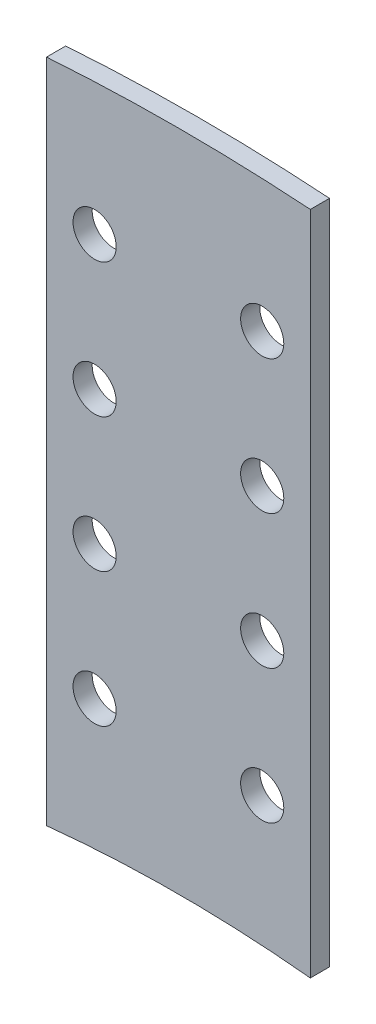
ISO-10303-21;
HEADER;
FILE_DESCRIPTION(('STEP AP214'),'2;1');
FILE_NAME('part.step','',(''),(''),'','','');
FILE_SCHEMA(('AUTOMOTIVE_DESIGN { 1 0 10303 214 1 1 1 1 }'));
ENDSEC;
DATA;
#1=APPLICATION_CONTEXT('core data for automotive mechanical design processes');
#2=APPLICATION_PROTOCOL_DEFINITION('international standard','automotive_design',2000,#1);
#3=PRODUCT_CONTEXT('',#1,'mechanical');
#4=PRODUCT('Part','Part','',(#3));
#5=PRODUCT_RELATED_PRODUCT_CATEGORY('part','',(#4));
#6=PRODUCT_DEFINITION_FORMATION('','',#4);
#7=PRODUCT_DEFINITION_CONTEXT('part definition',#1,'design');
#8=PRODUCT_DEFINITION('design','',#6,#7);
#9=PRODUCT_DEFINITION_SHAPE('','',#8);
#10=(LENGTH_UNIT() NAMED_UNIT(*) SI_UNIT(.MILLI.,.METRE.));
#11=(NAMED_UNIT(*) PLANE_ANGLE_UNIT() SI_UNIT($,.RADIAN.));
#12=(NAMED_UNIT(*) SI_UNIT($,.STERADIAN.) SOLID_ANGLE_UNIT());
#13=UNCERTAINTY_MEASURE_WITH_UNIT(LENGTH_MEASURE(1.E-05),#10,'distance_accuracy_value','');
#14=(GEOMETRIC_REPRESENTATION_CONTEXT(3) GLOBAL_UNCERTAINTY_ASSIGNED_CONTEXT((#13)) GLOBAL_UNIT_ASSIGNED_CONTEXT((#10,
#11,#12)) REPRESENTATION_CONTEXT('',''));
#15=CARTESIAN_POINT('',(0.,0.,0.));
#16=DIRECTION('',(0.,0.,1.));
#17=DIRECTION('',(1.,0.,0.));
#18=AXIS2_PLACEMENT_3D('',#15,#16,#17);
#19=CARTESIAN_POINT('',(0.,0.,8.));
#20=DIRECTION('',(0.,0.,-1.));
#21=DIRECTION('',(-1.,0.,0.));
#22=AXIS2_PLACEMENT_3D('',#19,#20,#21);
#23=PLANE('',#22);
#24=CARTESIAN_POINT('',(34.94,27.955,8.));
#25=DIRECTION('',(0.,0.,1.));
#26=DIRECTION('',(1.,0.,0.));
#27=AXIS2_PLACEMENT_3D('',#24,#25,#26);
#28=CIRCLE('',#27,9.00000000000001);
#29=CARTESIAN_POINT('',(43.94,27.955,8.));
#30=VERTEX_POINT('',#29);
#31=EDGE_CURVE('E327',#30,#30,#28,.T.);
#32=ORIENTED_EDGE('',*,*,#31,.F.);
#33=EDGE_LOOP('',(#32));
#34=FACE_BOUND('',#33,.T.);
#35=CARTESIAN_POINT('',(-34.94,27.955,8.));
#36=DIRECTION('',(0.,0.,1.));
#37=DIRECTION('',(1.,0.,0.));
#38=AXIS2_PLACEMENT_3D('',#35,#36,#37);
#39=CIRCLE('',#38,9.00000000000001);
#40=CARTESIAN_POINT('',(-25.94,27.955,8.));
#41=VERTEX_POINT('',#40);
#42=EDGE_CURVE('E335',#41,#41,#39,.T.);
#43=ORIENTED_EDGE('',*,*,#42,.F.);
#44=EDGE_LOOP('',(#43));
#45=FACE_BOUND('',#44,.T.);
#46=CARTESIAN_POINT('',(-34.94,83.835,8.));
#47=DIRECTION('',(0.,0.,1.));
#48=DIRECTION('',(1.,0.,0.));
#49=AXIS2_PLACEMENT_3D('',#46,#47,#48);
#50=CIRCLE('',#49,9.00000000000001);
#51=CARTESIAN_POINT('',(-25.94,83.835,8.));
#52=VERTEX_POINT('',#51);
#53=EDGE_CURVE('E342',#52,#52,#50,.T.);
#54=ORIENTED_EDGE('',*,*,#53,.F.);
#55=EDGE_LOOP('',(#54));
#56=FACE_BOUND('',#55,.T.);
#57=CARTESIAN_POINT('',(34.94,83.835,8.));
#58=DIRECTION('',(0.,0.,1.));
#59=DIRECTION('',(1.,0.,0.));
#60=AXIS2_PLACEMENT_3D('',#57,#58,#59);
#61=CIRCLE('',#60,9.00000000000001);
#62=CARTESIAN_POINT('',(43.94,83.835,8.));
#63=VERTEX_POINT('',#62);
#64=EDGE_CURVE('E132',#63,#63,#61,.T.);
#65=ORIENTED_EDGE('',*,*,#64,.F.);
#66=EDGE_LOOP('',(#65));
#67=FACE_BOUND('',#66,.T.);
#68=CARTESIAN_POINT('',(-34.94,-27.925,8.));
#69=DIRECTION('',(0.,0.,1.));
#70=DIRECTION('',(1.,0.,0.));
#71=AXIS2_PLACEMENT_3D('',#68,#69,#70);
#72=CIRCLE('',#71,9.00000000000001);
#73=CARTESIAN_POINT('',(-25.94,-27.925,8.));
#74=VERTEX_POINT('',#73);
#75=EDGE_CURVE('E144',#74,#74,#72,.T.);
#76=ORIENTED_EDGE('',*,*,#75,.F.);
#77=EDGE_LOOP('',(#76));
#78=FACE_BOUND('',#77,.T.);
#79=CARTESIAN_POINT('',(-34.94,-83.805,8.));
#80=DIRECTION('',(0.,0.,1.));
#81=DIRECTION('',(1.,0.,0.));
#82=AXIS2_PLACEMENT_3D('',#79,#80,#81);
#83=CIRCLE('',#82,9.00000000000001);
#84=CARTESIAN_POINT('',(-25.94,-83.805,8.));
#85=VERTEX_POINT('',#84);
#86=EDGE_CURVE('E152',#85,#85,#83,.T.);
#87=ORIENTED_EDGE('',*,*,#86,.F.);
#88=EDGE_LOOP('',(#87));
#89=FACE_BOUND('',#88,.T.);
#90=CARTESIAN_POINT('',(34.94,-27.925,8.));
#91=DIRECTION('',(0.,0.,1.));
#92=DIRECTION('',(1.,0.,0.));
#93=AXIS2_PLACEMENT_3D('',#90,#91,#92);
#94=CIRCLE('',#93,9.00000000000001);
#95=CARTESIAN_POINT('',(43.94,-27.925,8.));
#96=VERTEX_POINT('',#95);
#97=EDGE_CURVE('E160',#96,#96,#94,.T.);
#98=ORIENTED_EDGE('',*,*,#97,.F.);
#99=EDGE_LOOP('',(#98));
#100=FACE_BOUND('',#99,.T.);
#101=CARTESIAN_POINT('',(34.94,-83.805,8.));
#102=DIRECTION('',(0.,0.,1.));
#103=DIRECTION('',(1.,0.,0.));
#104=AXIS2_PLACEMENT_3D('',#101,#102,#103);
#105=CIRCLE('',#104,9.00000000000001);
#106=CARTESIAN_POINT('',(43.94,-83.805,8.));
#107=VERTEX_POINT('',#106);
#108=EDGE_CURVE('E12',#107,#107,#105,.T.);
#109=ORIENTED_EDGE('',*,*,#108,.F.);
#110=EDGE_LOOP('',(#109));
#111=FACE_BOUND('',#110,.T.);
#112=DIRECTION('',(0.,-1.,0.));
#113=VECTOR('',#112,1.);
#114=CARTESIAN_POINT('',(-55.,-139.715,8.));
#115=LINE('',#114,#113);
#116=CARTESIAN_POINT('',(-55.,137.819642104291,8.));
#117=VERTEX_POINT('',#116);
#118=CARTESIAN_POINT('',(-55.,-139.715,8.));
#119=VERTEX_POINT('',#118);
#120=EDGE_CURVE('E109',#117,#119,#115,.T.);
#121=ORIENTED_EDGE('',*,*,#120,.T.);
#122=CARTESIAN_POINT('',(0.,-676.906772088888,8.));
#123=DIRECTION('',(0.,0.,1.));
#124=DIRECTION('',(1.,0.,0.));
#125=AXIS2_PLACEMENT_3D('',#122,#123,#124);
#126=CIRCLE('',#125,540.);
#127=CARTESIAN_POINT('',(55.,-139.715,8.));
#128=VERTEX_POINT('',#127);
#129=EDGE_CURVE('E101',#128,#119,#126,.T.);
#130=ORIENTED_EDGE('',*,*,#129,.F.);
#131=DIRECTION('',(0.,1.,0.));
#132=VECTOR('',#131,1.);
#133=CARTESIAN_POINT('',(55.,-139.715,8.));
#134=LINE('',#133,#132);
#135=CARTESIAN_POINT('',(55.,137.819642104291,8.));
#136=VERTEX_POINT('',#135);
#137=EDGE_CURVE('E114',#128,#136,#134,.T.);
#138=ORIENTED_EDGE('',*,*,#137,.T.);
#139=CARTESIAN_POINT('',(0.,-659.235,8.));
#140=DIRECTION('',(0.,0.,1.));
#141=DIRECTION('',(1.,0.,0.));
#142=AXIS2_PLACEMENT_3D('',#139,#140,#141);
#143=CIRCLE('',#142,798.95);
#144=EDGE_CURVE('E312',#136,#117,#143,.T.);
#145=ORIENTED_EDGE('',*,*,#144,.T.);
#146=EDGE_LOOP('',(#121,#130,#138,#145));
#147=FACE_BOUND('',#146,.T.);
#148=ADVANCED_FACE('F59',(#34,#45,#56,#67,#78,#89,#100,#111,#147),#23,.F.);
#149=CARTESIAN_POINT('',(0.,0.,0.));
#150=DIRECTION('',(0.,0.,-1.));
#151=DIRECTION('',(-1.,0.,0.));
#152=AXIS2_PLACEMENT_3D('',#149,#150,#151);
#153=PLANE('',#152);
#154=CARTESIAN_POINT('',(0.,-676.906772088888,0.));
#155=DIRECTION('',(0.,0.,1.));
#156=DIRECTION('',(1.,0.,0.));
#157=AXIS2_PLACEMENT_3D('',#154,#155,#156);
#158=CIRCLE('',#157,540.);
#159=CARTESIAN_POINT('',(55.,-139.715,0.));
#160=VERTEX_POINT('',#159);
#161=CARTESIAN_POINT('',(-55.,-139.715,0.));
#162=VERTEX_POINT('',#161);
#163=EDGE_CURVE('E75',#160,#162,#158,.T.);
#164=ORIENTED_EDGE('',*,*,#163,.T.);
#165=DIRECTION('',(0.,-1.,0.));
#166=VECTOR('',#165,1.);
#167=CARTESIAN_POINT('',(-55.,-139.715,0.));
#168=LINE('',#167,#166);
#169=CARTESIAN_POINT('',(-55.,137.819642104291,0.));
#170=VERTEX_POINT('',#169);
#171=EDGE_CURVE('E123',#170,#162,#168,.T.);
#172=ORIENTED_EDGE('',*,*,#171,.F.);
#173=CARTESIAN_POINT('',(0.,-659.235,0.));
#174=DIRECTION('',(0.,0.,1.));
#175=DIRECTION('',(1.,0.,0.));
#176=AXIS2_PLACEMENT_3D('',#173,#174,#175);
#177=CIRCLE('',#176,798.95);
#178=CARTESIAN_POINT('',(55.,137.819642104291,0.));
#179=VERTEX_POINT('',#178);
#180=EDGE_CURVE('E84',#179,#170,#177,.T.);
#181=ORIENTED_EDGE('',*,*,#180,.F.);
#182=DIRECTION('',(0.,1.,0.));
#183=VECTOR('',#182,1.);
#184=CARTESIAN_POINT('',(55.,-139.715,0.));
#185=LINE('',#184,#183);
#186=EDGE_CURVE('E129',#160,#179,#185,.T.);
#187=ORIENTED_EDGE('',*,*,#186,.F.);
#188=EDGE_LOOP('',(#164,#172,#181,#187));
#189=FACE_BOUND('',#188,.T.);
#190=CARTESIAN_POINT('',(34.94,27.955,0.));
#191=DIRECTION('',(0.,0.,1.));
#192=DIRECTION('',(1.,0.,0.));
#193=AXIS2_PLACEMENT_3D('',#190,#191,#192);
#194=CIRCLE('',#193,9.00000000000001);
#195=CARTESIAN_POINT('',(43.94,27.955,0.));
#196=VERTEX_POINT('',#195);
#197=EDGE_CURVE('E323',#196,#196,#194,.T.);
#198=ORIENTED_EDGE('',*,*,#197,.T.);
#199=EDGE_LOOP('',(#198));
#200=FACE_BOUND('',#199,.T.);
#201=CARTESIAN_POINT('',(-34.94,27.955,0.));
#202=DIRECTION('',(0.,0.,1.));
#203=DIRECTION('',(1.,0.,0.));
#204=AXIS2_PLACEMENT_3D('',#201,#202,#203);
#205=CIRCLE('',#204,9.00000000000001);
#206=CARTESIAN_POINT('',(-25.94,27.955,0.));
#207=VERTEX_POINT('',#206);
#208=EDGE_CURVE('E331',#207,#207,#205,.T.);
#209=ORIENTED_EDGE('',*,*,#208,.T.);
#210=EDGE_LOOP('',(#209));
#211=FACE_BOUND('',#210,.T.);
#212=CARTESIAN_POINT('',(-34.94,83.835,0.));
#213=DIRECTION('',(0.,0.,1.));
#214=DIRECTION('',(1.,0.,0.));
#215=AXIS2_PLACEMENT_3D('',#212,#213,#214);
#216=CIRCLE('',#215,9.00000000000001);
#217=CARTESIAN_POINT('',(-25.94,83.835,0.));
#218=VERTEX_POINT('',#217);
#219=EDGE_CURVE('E136',#218,#218,#216,.T.);
#220=ORIENTED_EDGE('',*,*,#219,.T.);
#221=EDGE_LOOP('',(#220));
#222=FACE_BOUND('',#221,.T.);
#223=CARTESIAN_POINT('',(34.94,83.835,0.));
#224=DIRECTION('',(0.,0.,1.));
#225=DIRECTION('',(1.,0.,0.));
#226=AXIS2_PLACEMENT_3D('',#223,#224,#225);
#227=CIRCLE('',#226,9.00000000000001);
#228=CARTESIAN_POINT('',(43.94,83.835,0.));
#229=VERTEX_POINT('',#228);
#230=EDGE_CURVE('E345',#229,#229,#227,.T.);
#231=ORIENTED_EDGE('',*,*,#230,.T.);
#232=EDGE_LOOP('',(#231));
#233=FACE_BOUND('',#232,.T.);
#234=CARTESIAN_POINT('',(-34.94,-27.925,0.));
#235=DIRECTION('',(0.,0.,1.));
#236=DIRECTION('',(1.,0.,0.));
#237=AXIS2_PLACEMENT_3D('',#234,#235,#236);
#238=CIRCLE('',#237,9.00000000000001);
#239=CARTESIAN_POINT('',(-25.94,-27.925,0.));
#240=VERTEX_POINT('',#239);
#241=EDGE_CURVE('E140',#240,#240,#238,.T.);
#242=ORIENTED_EDGE('',*,*,#241,.T.);
#243=EDGE_LOOP('',(#242));
#244=FACE_BOUND('',#243,.T.);
#245=CARTESIAN_POINT('',(-34.94,-83.805,0.));
#246=DIRECTION('',(0.,0.,1.));
#247=DIRECTION('',(1.,0.,0.));
#248=AXIS2_PLACEMENT_3D('',#245,#246,#247);
#249=CIRCLE('',#248,9.00000000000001);
#250=CARTESIAN_POINT('',(-25.94,-83.805,0.));
#251=VERTEX_POINT('',#250);
#252=EDGE_CURVE('E148',#251,#251,#249,.T.);
#253=ORIENTED_EDGE('',*,*,#252,.T.);
#254=EDGE_LOOP('',(#253));
#255=FACE_BOUND('',#254,.T.);
#256=CARTESIAN_POINT('',(34.94,-27.925,0.));
#257=DIRECTION('',(0.,0.,1.));
#258=DIRECTION('',(1.,0.,0.));
#259=AXIS2_PLACEMENT_3D('',#256,#257,#258);
#260=CIRCLE('',#259,9.00000000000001);
#261=CARTESIAN_POINT('',(43.94,-27.925,0.));
#262=VERTEX_POINT('',#261);
#263=EDGE_CURVE('E156',#262,#262,#260,.T.);
#264=ORIENTED_EDGE('',*,*,#263,.T.);
#265=EDGE_LOOP('',(#264));
#266=FACE_BOUND('',#265,.T.);
#267=CARTESIAN_POINT('',(34.94,-83.805,0.));
#268=DIRECTION('',(0.,0.,1.));
#269=DIRECTION('',(1.,0.,0.));
#270=AXIS2_PLACEMENT_3D('',#267,#268,#269);
#271=CIRCLE('',#270,9.00000000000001);
#272=CARTESIAN_POINT('',(43.94,-83.805,0.));
#273=VERTEX_POINT('',#272);
#274=EDGE_CURVE('E68',#273,#273,#271,.T.);
#275=ORIENTED_EDGE('',*,*,#274,.T.);
#276=EDGE_LOOP('',(#275));
#277=FACE_BOUND('',#276,.T.);
#278=ADVANCED_FACE('F167',(#189,#200,#211,#222,#233,#244,#255,#266,#277),#153,.T.);
#279=CARTESIAN_POINT('',(55.,-139.715,8.));
#280=DIRECTION('',(-1.,0.,0.));
#281=DIRECTION('',(0.,0.,1.));
#282=AXIS2_PLACEMENT_3D('',#279,#280,#281);
#283=PLANE('',#282);
#284=DIRECTION('',(0.,0.,1.));
#285=VECTOR('',#284,1.);
#286=CARTESIAN_POINT('',(55.,137.819642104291,0.));
#287=LINE('',#286,#285);
#288=EDGE_CURVE('E121',#179,#136,#287,.T.);
#289=ORIENTED_EDGE('',*,*,#288,.T.);
#290=ORIENTED_EDGE('',*,*,#137,.F.);
#291=DIRECTION('',(0.,0.,-1.));
#292=VECTOR('',#291,1.);
#293=CARTESIAN_POINT('',(55.,-139.715,8.));
#294=LINE('',#293,#292);
#295=EDGE_CURVE('E98',#128,#160,#294,.T.);
#296=ORIENTED_EDGE('',*,*,#295,.T.);
#297=ORIENTED_EDGE('',*,*,#186,.T.);
#298=EDGE_LOOP('',(#289,#290,#296,#297));
#299=FACE_BOUND('',#298,.T.);
#300=ADVANCED_FACE('F120',(#299),#283,.F.);
#301=CARTESIAN_POINT('',(-55.,-139.715,8.));
#302=DIRECTION('',(1.,0.,0.));
#303=DIRECTION('',(0.,0.,-1.));
#304=AXIS2_PLACEMENT_3D('',#301,#302,#303);
#305=PLANE('',#304);
#306=DIRECTION('',(0.,0.,1.));
#307=VECTOR('',#306,1.);
#308=CARTESIAN_POINT('',(-55.,137.819642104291,0.));
#309=LINE('',#308,#307);
#310=EDGE_CURVE('E313',#170,#117,#309,.T.);
#311=ORIENTED_EDGE('',*,*,#310,.F.);
#312=ORIENTED_EDGE('',*,*,#171,.T.);
#313=DIRECTION('',(0.,0.,-1.));
#314=VECTOR('',#313,1.);
#315=CARTESIAN_POINT('',(-55.,-139.715,8.));
#316=LINE('',#315,#314);
#317=EDGE_CURVE('E108',#119,#162,#316,.T.);
#318=ORIENTED_EDGE('',*,*,#317,.F.);
#319=ORIENTED_EDGE('',*,*,#120,.F.);
#320=EDGE_LOOP('',(#311,#312,#318,#319));
#321=FACE_BOUND('',#320,.T.);
#322=ADVANCED_FACE('F172',(#321),#305,.F.);
#323=CARTESIAN_POINT('',(34.94,-83.805,0.));
#324=DIRECTION('',(0.,0.,1.));
#325=DIRECTION('',(1.,0.,0.));
#326=AXIS2_PLACEMENT_3D('',#323,#324,#325);
#327=CYLINDRICAL_SURFACE('',#326,9.00000000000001);
#328=ORIENTED_EDGE('',*,*,#274,.F.);
#329=EDGE_LOOP('',(#328));
#330=FACE_BOUND('',#329,.T.);
#331=ORIENTED_EDGE('',*,*,#108,.T.);
#332=EDGE_LOOP('',(#331));
#333=FACE_BOUND('',#332,.T.);
#334=ADVANCED_FACE('F61',(#330,#333),#327,.F.);
#335=CARTESIAN_POINT('',(34.94,-27.925,0.));
#336=DIRECTION('',(0.,0.,1.));
#337=DIRECTION('',(1.,0.,0.));
#338=AXIS2_PLACEMENT_3D('',#335,#336,#337);
#339=CYLINDRICAL_SURFACE('',#338,9.00000000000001);
#340=ORIENTED_EDGE('',*,*,#263,.F.);
#341=EDGE_LOOP('',(#340));
#342=FACE_BOUND('',#341,.T.);
#343=ORIENTED_EDGE('',*,*,#97,.T.);
#344=EDGE_LOOP('',(#343));
#345=FACE_BOUND('',#344,.T.);
#346=ADVANCED_FACE('F171',(#342,#345),#339,.F.);
#347=CARTESIAN_POINT('',(-34.94,-83.805,0.));
#348=DIRECTION('',(0.,0.,1.));
#349=DIRECTION('',(1.,0.,0.));
#350=AXIS2_PLACEMENT_3D('',#347,#348,#349);
#351=CYLINDRICAL_SURFACE('',#350,9.00000000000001);
#352=ORIENTED_EDGE('',*,*,#252,.F.);
#353=EDGE_LOOP('',(#352));
#354=FACE_BOUND('',#353,.T.);
#355=ORIENTED_EDGE('',*,*,#86,.T.);
#356=EDGE_LOOP('',(#355));
#357=FACE_BOUND('',#356,.T.);
#358=ADVANCED_FACE('F197',(#354,#357),#351,.F.);
#359=CARTESIAN_POINT('',(-34.94,-27.925,0.));
#360=DIRECTION('',(0.,0.,1.));
#361=DIRECTION('',(1.,0.,0.));
#362=AXIS2_PLACEMENT_3D('',#359,#360,#361);
#363=CYLINDRICAL_SURFACE('',#362,9.00000000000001);
#364=ORIENTED_EDGE('',*,*,#241,.F.);
#365=EDGE_LOOP('',(#364));
#366=FACE_BOUND('',#365,.T.);
#367=ORIENTED_EDGE('',*,*,#75,.T.);
#368=EDGE_LOOP('',(#367));
#369=FACE_BOUND('',#368,.T.);
#370=ADVANCED_FACE('F194',(#366,#369),#363,.F.);
#371=CARTESIAN_POINT('',(34.94,83.835,0.));
#372=DIRECTION('',(0.,0.,1.));
#373=DIRECTION('',(1.,0.,0.));
#374=AXIS2_PLACEMENT_3D('',#371,#372,#373);
#375=CYLINDRICAL_SURFACE('',#374,9.00000000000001);
#376=ORIENTED_EDGE('',*,*,#230,.F.);
#377=EDGE_LOOP('',(#376));
#378=FACE_BOUND('',#377,.T.);
#379=ORIENTED_EDGE('',*,*,#64,.T.);
#380=EDGE_LOOP('',(#379));
#381=FACE_BOUND('',#380,.T.);
#382=ADVANCED_FACE('F186',(#378,#381),#375,.F.);
#383=CARTESIAN_POINT('',(-34.94,83.835,0.));
#384=DIRECTION('',(0.,0.,1.));
#385=DIRECTION('',(1.,0.,0.));
#386=AXIS2_PLACEMENT_3D('',#383,#384,#385);
#387=CYLINDRICAL_SURFACE('',#386,9.00000000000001);
#388=ORIENTED_EDGE('',*,*,#219,.F.);
#389=EDGE_LOOP('',(#388));
#390=FACE_BOUND('',#389,.T.);
#391=ORIENTED_EDGE('',*,*,#53,.T.);
#392=EDGE_LOOP('',(#391));
#393=FACE_BOUND('',#392,.T.);
#394=ADVANCED_FACE('F227',(#390,#393),#387,.F.);
#395=CARTESIAN_POINT('',(-34.94,27.955,0.));
#396=DIRECTION('',(0.,0.,1.));
#397=DIRECTION('',(1.,0.,0.));
#398=AXIS2_PLACEMENT_3D('',#395,#396,#397);
#399=CYLINDRICAL_SURFACE('',#398,9.00000000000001);
#400=ORIENTED_EDGE('',*,*,#208,.F.);
#401=EDGE_LOOP('',(#400));
#402=FACE_BOUND('',#401,.T.);
#403=ORIENTED_EDGE('',*,*,#42,.T.);
#404=EDGE_LOOP('',(#403));
#405=FACE_BOUND('',#404,.T.);
#406=ADVANCED_FACE('F234',(#402,#405),#399,.F.);
#407=CARTESIAN_POINT('',(34.94,27.955,0.));
#408=DIRECTION('',(0.,0.,1.));
#409=DIRECTION('',(1.,0.,0.));
#410=AXIS2_PLACEMENT_3D('',#407,#408,#409);
#411=CYLINDRICAL_SURFACE('',#410,9.00000000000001);
#412=ORIENTED_EDGE('',*,*,#197,.F.);
#413=EDGE_LOOP('',(#412));
#414=FACE_BOUND('',#413,.T.);
#415=ORIENTED_EDGE('',*,*,#31,.T.);
#416=EDGE_LOOP('',(#415));
#417=FACE_BOUND('',#416,.T.);
#418=ADVANCED_FACE('F240',(#414,#417),#411,.F.);
#419=CARTESIAN_POINT('',(0.,-659.235,0.));
#420=DIRECTION('',(0.,0.,1.));
#421=DIRECTION('',(1.,0.,0.));
#422=AXIS2_PLACEMENT_3D('',#419,#420,#421);
#423=CYLINDRICAL_SURFACE('',#422,798.95);
#424=ORIENTED_EDGE('',*,*,#144,.F.);
#425=ORIENTED_EDGE('',*,*,#288,.F.);
#426=ORIENTED_EDGE('',*,*,#180,.T.);
#427=ORIENTED_EDGE('',*,*,#310,.T.);
#428=EDGE_LOOP('',(#424,#425,#426,#427));
#429=FACE_BOUND('',#428,.T.);
#430=ADVANCED_FACE('F248',(#429),#423,.T.);
#431=CARTESIAN_POINT('',(0.,-676.906772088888,0.));
#432=DIRECTION('',(0.,0.,1.));
#433=DIRECTION('',(1.,0.,0.));
#434=AXIS2_PLACEMENT_3D('',#431,#432,#433);
#435=CYLINDRICAL_SURFACE('',#434,540.);
#436=ORIENTED_EDGE('',*,*,#163,.F.);
#437=ORIENTED_EDGE('',*,*,#295,.F.);
#438=ORIENTED_EDGE('',*,*,#129,.T.);
#439=ORIENTED_EDGE('',*,*,#317,.T.);
#440=EDGE_LOOP('',(#436,#437,#438,#439));
#441=FACE_BOUND('',#440,.T.);
#442=ADVANCED_FACE('F100',(#441),#435,.F.);
#443=CLOSED_SHELL('',(#148,#278,#300,#322,#334,#346,#358,#370,#382,#394,#406,#418,#430,#442));
#444=MANIFOLD_SOLID_BREP('B2',#443);
#445=ADVANCED_BREP_SHAPE_REPRESENTATION('',(#18,#444),#14);
#446=SHAPE_DEFINITION_REPRESENTATION(#9,#445);
ENDSEC;
END-ISO-10303-21;
